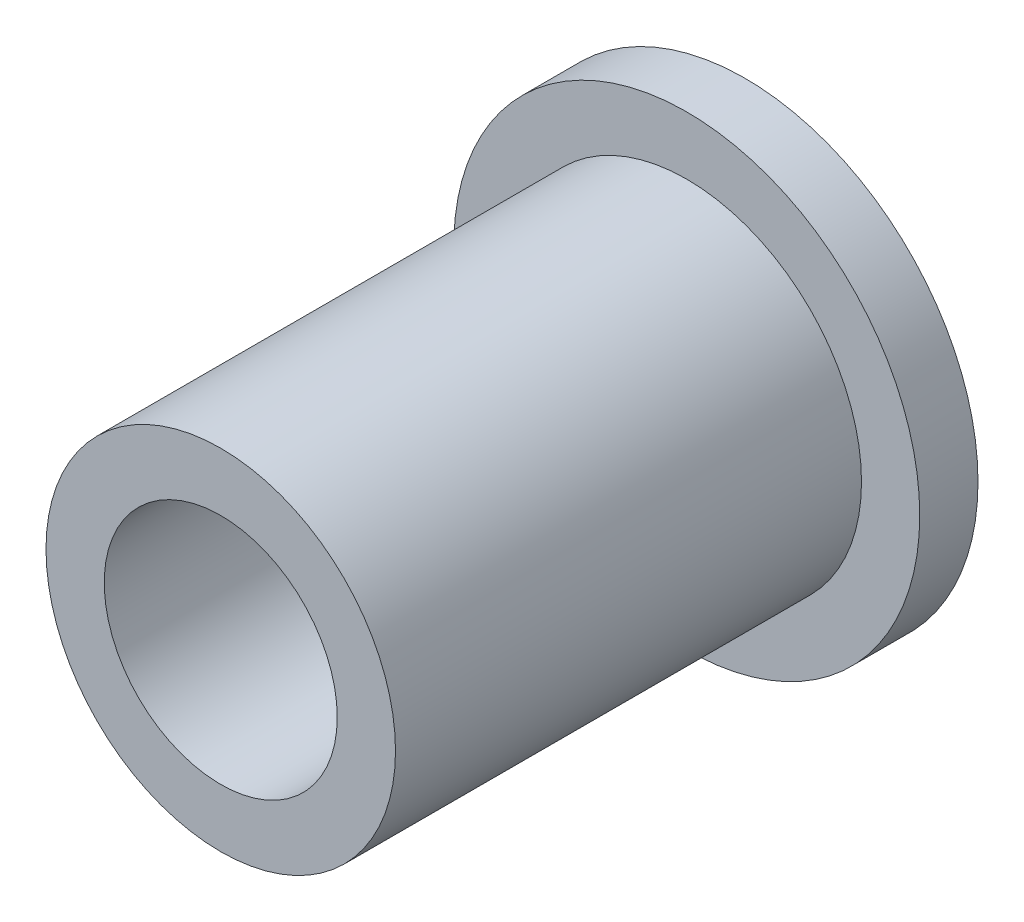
ISO-10303-21;
HEADER;
FILE_DESCRIPTION(('STEP AP214'),'2;1');
FILE_NAME('part.step','',(''),(''),'','','');
FILE_SCHEMA(('AUTOMOTIVE_DESIGN { 1 0 10303 214 1 1 1 1 }'));
ENDSEC;
DATA;
#1=APPLICATION_CONTEXT('core data for automotive mechanical design processes');
#2=APPLICATION_PROTOCOL_DEFINITION('international standard','automotive_design',2000,#1);
#3=PRODUCT_CONTEXT('',#1,'mechanical');
#4=PRODUCT('Part','Part','',(#3));
#5=PRODUCT_RELATED_PRODUCT_CATEGORY('part','',(#4));
#6=PRODUCT_DEFINITION_FORMATION('','',#4);
#7=PRODUCT_DEFINITION_CONTEXT('part definition',#1,'design');
#8=PRODUCT_DEFINITION('design','',#6,#7);
#9=PRODUCT_DEFINITION_SHAPE('','',#8);
#10=(LENGTH_UNIT() NAMED_UNIT(*) SI_UNIT(.MILLI.,.METRE.));
#11=(NAMED_UNIT(*) PLANE_ANGLE_UNIT() SI_UNIT($,.RADIAN.));
#12=(NAMED_UNIT(*) SI_UNIT($,.STERADIAN.) SOLID_ANGLE_UNIT());
#13=UNCERTAINTY_MEASURE_WITH_UNIT(LENGTH_MEASURE(1.E-05),#10,'distance_accuracy_value','');
#14=(GEOMETRIC_REPRESENTATION_CONTEXT(3) GLOBAL_UNCERTAINTY_ASSIGNED_CONTEXT((#13)) GLOBAL_UNIT_ASSIGNED_CONTEXT((#10,
#11,#12)) REPRESENTATION_CONTEXT('',''));
#15=CARTESIAN_POINT('',(0.,0.,0.));
#16=DIRECTION('',(0.,0.,1.));
#17=DIRECTION('',(1.,0.,0.));
#18=AXIS2_PLACEMENT_3D('',#15,#16,#17);
#19=CARTESIAN_POINT('',(0.,0.,1.5875));
#20=DIRECTION('',(0.,0.,1.));
#21=DIRECTION('',(1.,0.,0.));
#22=AXIS2_PLACEMENT_3D('',#19,#20,#21);
#23=PLANE('',#22);
#24=CARTESIAN_POINT('',(0.,0.,1.5875));
#25=DIRECTION('',(0.,0.,1.));
#26=DIRECTION('',(1.,0.,0.));
#27=AXIS2_PLACEMENT_3D('',#24,#25,#26);
#28=CIRCLE('',#27,6.35);
#29=CARTESIAN_POINT('',(6.35,0.,1.5875));
#30=VERTEX_POINT('',#29);
#31=EDGE_CURVE('E10',#30,#30,#28,.T.);
#32=ORIENTED_EDGE('',*,*,#31,.T.);
#33=EDGE_LOOP('',(#32));
#34=FACE_BOUND('',#33,.T.);
#35=CARTESIAN_POINT('',(0.,0.,1.5875));
#36=DIRECTION('',(0.,0.,1.));
#37=DIRECTION('',(1.,0.,0.));
#38=AXIS2_PLACEMENT_3D('',#35,#36,#37);
#39=CIRCLE('',#38,4.7625);
#40=CARTESIAN_POINT('',(4.7625,0.,1.5875));
#41=VERTEX_POINT('',#40);
#42=EDGE_CURVE('E46',#41,#41,#39,.T.);
#43=ORIENTED_EDGE('',*,*,#42,.F.);
#44=EDGE_LOOP('',(#43));
#45=FACE_BOUND('',#44,.T.);
#46=ADVANCED_FACE('F33',(#34,#45),#23,.T.);
#47=CARTESIAN_POINT('',(0.,0.,1.5875));
#48=DIRECTION('',(0.,0.,-1.));
#49=DIRECTION('',(-1.,0.,0.));
#50=AXIS2_PLACEMENT_3D('',#47,#48,#49);
#51=CYLINDRICAL_SURFACE('',#50,6.35);
#52=ORIENTED_EDGE('',*,*,#31,.F.);
#53=EDGE_LOOP('',(#52));
#54=FACE_BOUND('',#53,.T.);
#55=CARTESIAN_POINT('',(0.,0.,0.));
#56=DIRECTION('',(0.,0.,1.));
#57=DIRECTION('',(1.,0.,0.));
#58=AXIS2_PLACEMENT_3D('',#55,#56,#57);
#59=CIRCLE('',#58,6.35);
#60=CARTESIAN_POINT('',(6.35,0.,0.));
#61=VERTEX_POINT('',#60);
#62=EDGE_CURVE('E37',#61,#61,#59,.T.);
#63=ORIENTED_EDGE('',*,*,#62,.T.);
#64=EDGE_LOOP('',(#63));
#65=FACE_BOUND('',#64,.T.);
#66=ADVANCED_FACE('F35',(#54,#65),#51,.T.);
#67=CARTESIAN_POINT('',(0.,0.,0.));
#68=DIRECTION('',(0.,0.,1.));
#69=DIRECTION('',(1.,0.,0.));
#70=AXIS2_PLACEMENT_3D('',#67,#68,#69);
#71=PLANE('',#70);
#72=CARTESIAN_POINT('',(0.,0.,0.));
#73=DIRECTION('',(0.,0.,1.));
#74=DIRECTION('',(1.,0.,0.));
#75=AXIS2_PLACEMENT_3D('',#72,#73,#74);
#76=CIRCLE('',#75,3.175);
#77=CARTESIAN_POINT('',(3.175,0.,0.));
#78=VERTEX_POINT('',#77);
#79=EDGE_CURVE('E49',#78,#78,#76,.T.);
#80=ORIENTED_EDGE('',*,*,#79,.T.);
#81=EDGE_LOOP('',(#80));
#82=FACE_BOUND('',#81,.T.);
#83=ORIENTED_EDGE('',*,*,#62,.F.);
#84=EDGE_LOOP('',(#83));
#85=FACE_BOUND('',#84,.T.);
#86=ADVANCED_FACE('F58',(#82,#85),#71,.F.);
#87=CARTESIAN_POINT('',(0.,0.,14.2875));
#88=DIRECTION('',(0.,0.,-1.));
#89=DIRECTION('',(-1.,0.,0.));
#90=AXIS2_PLACEMENT_3D('',#87,#88,#89);
#91=CYLINDRICAL_SURFACE('',#90,4.7625);
#92=CARTESIAN_POINT('',(0.,0.,14.2875));
#93=DIRECTION('',(0.,0.,1.));
#94=DIRECTION('',(1.,0.,0.));
#95=AXIS2_PLACEMENT_3D('',#92,#93,#94);
#96=CIRCLE('',#95,4.7625);
#97=CARTESIAN_POINT('',(4.7625,0.,14.2875));
#98=VERTEX_POINT('',#97);
#99=EDGE_CURVE('E44',#98,#98,#96,.T.);
#100=ORIENTED_EDGE('',*,*,#99,.F.);
#101=EDGE_LOOP('',(#100));
#102=FACE_BOUND('',#101,.T.);
#103=ORIENTED_EDGE('',*,*,#42,.T.);
#104=EDGE_LOOP('',(#103));
#105=FACE_BOUND('',#104,.T.);
#106=ADVANCED_FACE('F70',(#102,#105),#91,.T.);
#107=CARTESIAN_POINT('',(0.,0.,14.2875));
#108=DIRECTION('',(0.,0.,1.));
#109=DIRECTION('',(1.,0.,0.));
#110=AXIS2_PLACEMENT_3D('',#107,#108,#109);
#111=PLANE('',#110);
#112=CARTESIAN_POINT('',(0.,0.,14.2875));
#113=DIRECTION('',(0.,0.,1.));
#114=DIRECTION('',(1.,0.,0.));
#115=AXIS2_PLACEMENT_3D('',#112,#113,#114);
#116=CIRCLE('',#115,3.175);
#117=CARTESIAN_POINT('',(3.175,0.,14.2875));
#118=VERTEX_POINT('',#117);
#119=EDGE_CURVE('E52',#118,#118,#116,.T.);
#120=ORIENTED_EDGE('',*,*,#119,.F.);
#121=EDGE_LOOP('',(#120));
#122=FACE_BOUND('',#121,.T.);
#123=ORIENTED_EDGE('',*,*,#99,.T.);
#124=EDGE_LOOP('',(#123));
#125=FACE_BOUND('',#124,.T.);
#126=ADVANCED_FACE('F64',(#122,#125),#111,.T.);
#127=CARTESIAN_POINT('',(0.,0.,0.));
#128=DIRECTION('',(0.,0.,1.));
#129=DIRECTION('',(1.,0.,0.));
#130=AXIS2_PLACEMENT_3D('',#127,#128,#129);
#131=CYLINDRICAL_SURFACE('',#130,3.175);
#132=ORIENTED_EDGE('',*,*,#79,.F.);
#133=EDGE_LOOP('',(#132));
#134=FACE_BOUND('',#133,.T.);
#135=ORIENTED_EDGE('',*,*,#119,.T.);
#136=EDGE_LOOP('',(#135));
#137=FACE_BOUND('',#136,.T.);
#138=ADVANCED_FACE('F61',(#134,#137),#131,.F.);
#139=CLOSED_SHELL('',(#46,#66,#86,#106,#126,#138));
#140=MANIFOLD_SOLID_BREP('B2',#139);
#141=ADVANCED_BREP_SHAPE_REPRESENTATION('',(#18,#140),#14);
#142=SHAPE_DEFINITION_REPRESENTATION(#9,#141);
ENDSEC;
END-ISO-10303-21;
